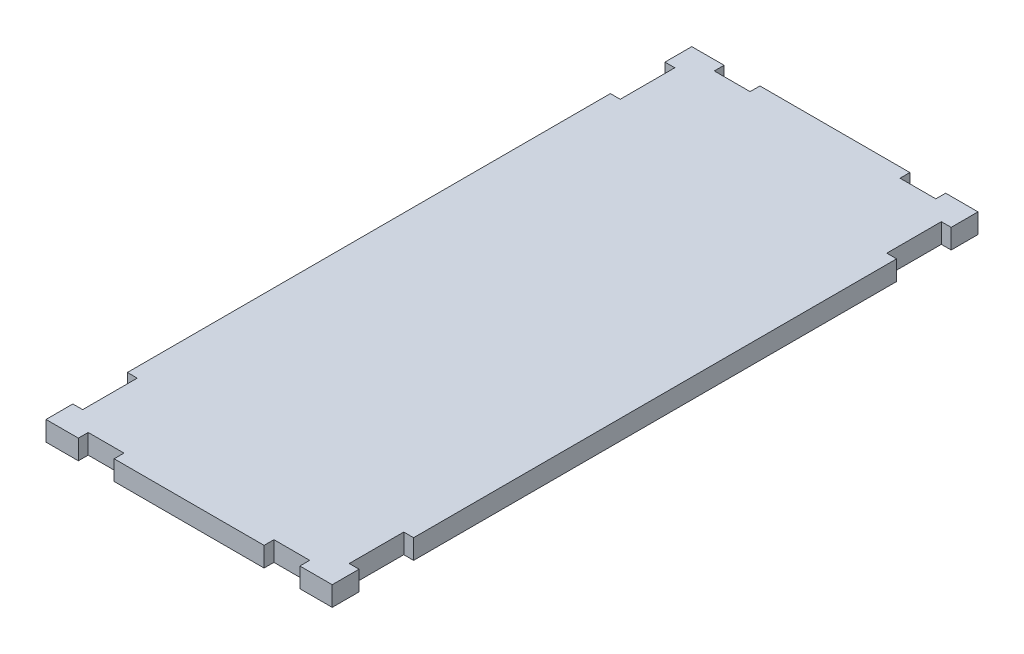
ISO-10303-21;
HEADER;
FILE_DESCRIPTION(('STEP AP214'),'2;1');
FILE_NAME('part.step','',(''),(''),'','','');
FILE_SCHEMA(('AUTOMOTIVE_DESIGN { 1 0 10303 214 1 1 1 1 }'));
ENDSEC;
DATA;
#1=APPLICATION_CONTEXT('core data for automotive mechanical design processes');
#2=APPLICATION_PROTOCOL_DEFINITION('international standard','automotive_design',2000,#1);
#3=PRODUCT_CONTEXT('',#1,'mechanical');
#4=PRODUCT('Part','Part','',(#3));
#5=PRODUCT_RELATED_PRODUCT_CATEGORY('part','',(#4));
#6=PRODUCT_DEFINITION_FORMATION('','',#4);
#7=PRODUCT_DEFINITION_CONTEXT('part definition',#1,'design');
#8=PRODUCT_DEFINITION('design','',#6,#7);
#9=PRODUCT_DEFINITION_SHAPE('','',#8);
#10=(LENGTH_UNIT() NAMED_UNIT(*) SI_UNIT(.MILLI.,.METRE.));
#11=(NAMED_UNIT(*) PLANE_ANGLE_UNIT() SI_UNIT($,.RADIAN.));
#12=(NAMED_UNIT(*) SI_UNIT($,.STERADIAN.) SOLID_ANGLE_UNIT());
#13=UNCERTAINTY_MEASURE_WITH_UNIT(LENGTH_MEASURE(1.E-05),#10,'distance_accuracy_value','');
#14=(GEOMETRIC_REPRESENTATION_CONTEXT(3) GLOBAL_UNCERTAINTY_ASSIGNED_CONTEXT((#13)) GLOBAL_UNIT_ASSIGNED_CONTEXT((#10,
#11,#12)) REPRESENTATION_CONTEXT('',''));
#15=CARTESIAN_POINT('',(0.,0.,0.));
#16=DIRECTION('',(0.,0.,1.));
#17=DIRECTION('',(1.,0.,0.));
#18=AXIS2_PLACEMENT_3D('',#15,#16,#17);
#19=CARTESIAN_POINT('',(80.0000000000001,5.5,0.));
#20=DIRECTION('',(-1.,0.,0.));
#21=DIRECTION('',(0.,0.,1.));
#22=AXIS2_PLACEMENT_3D('',#19,#20,#21);
#23=PLANE('',#22);
#24=DIRECTION('',(0.,0.,-1.));
#25=VECTOR('',#24,1.);
#26=CARTESIAN_POINT('',(80.0000000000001,0.,0.));
#27=LINE('',#26,#25);
#28=CARTESIAN_POINT('',(79.9999999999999,0.,-5.50000000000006));
#29=VERTEX_POINT('',#28);
#30=CARTESIAN_POINT('',(79.9999999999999,0.,-275.5));
#31=VERTEX_POINT('',#30);
#32=EDGE_CURVE('E568',#29,#31,#27,.T.);
#33=ORIENTED_EDGE('',*,*,#32,.T.);
#34=DIRECTION('',(0.,-1.,0.));
#35=VECTOR('',#34,1.);
#36=CARTESIAN_POINT('',(79.9999999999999,5.5,-275.5));
#37=LINE('',#36,#35);
#38=CARTESIAN_POINT('',(79.9999999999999,11.,-275.5));
#39=VERTEX_POINT('',#38);
#40=EDGE_CURVE('E11',#39,#31,#37,.T.);
#41=ORIENTED_EDGE('',*,*,#40,.F.);
#42=DIRECTION('',(0.,0.,-1.));
#43=VECTOR('',#42,1.);
#44=CARTESIAN_POINT('',(80.0000000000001,11.,0.));
#45=LINE('',#44,#43);
#46=CARTESIAN_POINT('',(79.9999999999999,11.,-5.50000000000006));
#47=VERTEX_POINT('',#46);
#48=EDGE_CURVE('E564',#47,#39,#45,.T.);
#49=ORIENTED_EDGE('',*,*,#48,.F.);
#50=DIRECTION('',(0.,-1.,0.));
#51=VECTOR('',#50,1.);
#52=CARTESIAN_POINT('',(79.9999999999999,5.5,-5.50000000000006));
#53=LINE('',#52,#51);
#54=EDGE_CURVE('E499',#47,#29,#53,.T.);
#55=ORIENTED_EDGE('',*,*,#54,.T.);
#56=EDGE_LOOP('',(#33,#41,#49,#55));
#57=FACE_BOUND('',#56,.T.);
#58=ADVANCED_FACE('F45',(#57),#23,.F.);
#59=CARTESIAN_POINT('',(0.,5.5,-275.5));
#60=DIRECTION('',(0.,0.,-1.));
#61=DIRECTION('',(-1.,0.,0.));
#62=AXIS2_PLACEMENT_3D('',#59,#60,#61);
#63=PLANE('',#62);
#64=DIRECTION('',(1.,0.,0.));
#65=VECTOR('',#64,1.);
#66=CARTESIAN_POINT('',(0.,0.,-275.5));
#67=LINE('',#66,#65);
#68=CARTESIAN_POINT('',(74.4999999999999,0.,-275.5));
#69=VERTEX_POINT('',#68);
#70=EDGE_CURVE('E572',#69,#31,#67,.T.);
#71=ORIENTED_EDGE('',*,*,#70,.F.);
#72=DIRECTION('',(0.,-1.,0.));
#73=VECTOR('',#72,1.);
#74=CARTESIAN_POINT('',(74.4999999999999,5.5,-275.5));
#75=LINE('',#74,#73);
#76=CARTESIAN_POINT('',(74.4999999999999,11.,-275.5));
#77=VERTEX_POINT('',#76);
#78=EDGE_CURVE('E53',#77,#69,#75,.T.);
#79=ORIENTED_EDGE('',*,*,#78,.F.);
#80=DIRECTION('',(1.,0.,0.));
#81=VECTOR('',#80,1.);
#82=CARTESIAN_POINT('',(0.,11.,-275.5));
#83=LINE('',#82,#81);
#84=EDGE_CURVE('E560',#77,#39,#83,.T.);
#85=ORIENTED_EDGE('',*,*,#84,.T.);
#86=ORIENTED_EDGE('',*,*,#40,.T.);
#87=EDGE_LOOP('',(#71,#79,#85,#86));
#88=FACE_BOUND('',#87,.T.);
#89=ADVANCED_FACE('F631',(#88),#63,.T.);
#90=CARTESIAN_POINT('',(74.4999999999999,5.5,0.));
#91=DIRECTION('',(1.,0.,0.));
#92=DIRECTION('',(0.,0.,-1.));
#93=AXIS2_PLACEMENT_3D('',#90,#91,#92);
#94=PLANE('',#93);
#95=DIRECTION('',(0.,0.,1.));
#96=VECTOR('',#95,1.);
#97=CARTESIAN_POINT('',(74.4999999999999,0.,0.));
#98=LINE('',#97,#96);
#99=CARTESIAN_POINT('',(74.4999999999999,0.,-306.));
#100=VERTEX_POINT('',#99);
#101=EDGE_CURVE('E576',#100,#69,#98,.T.);
#102=ORIENTED_EDGE('',*,*,#101,.F.);
#103=DIRECTION('',(0.,-1.,0.));
#104=VECTOR('',#103,1.);
#105=CARTESIAN_POINT('',(74.4999999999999,5.5,-306.));
#106=LINE('',#105,#104);
#107=CARTESIAN_POINT('',(74.4999999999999,11.,-306.));
#108=VERTEX_POINT('',#107);
#109=EDGE_CURVE('E621',#108,#100,#106,.T.);
#110=ORIENTED_EDGE('',*,*,#109,.F.);
#111=DIRECTION('',(0.,0.,1.));
#112=VECTOR('',#111,1.);
#113=CARTESIAN_POINT('',(74.4999999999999,11.,0.));
#114=LINE('',#113,#112);
#115=EDGE_CURVE('E556',#108,#77,#114,.T.);
#116=ORIENTED_EDGE('',*,*,#115,.T.);
#117=ORIENTED_EDGE('',*,*,#78,.T.);
#118=EDGE_LOOP('',(#102,#110,#116,#117));
#119=FACE_BOUND('',#118,.T.);
#120=ADVANCED_FACE('F627',(#119),#94,.T.);
#121=CARTESIAN_POINT('',(0.,5.5,-306.));
#122=DIRECTION('',(0.,0.,1.));
#123=DIRECTION('',(1.,0.,0.));
#124=AXIS2_PLACEMENT_3D('',#121,#122,#123);
#125=PLANE('',#124);
#126=DIRECTION('',(-1.,0.,0.));
#127=VECTOR('',#126,1.);
#128=CARTESIAN_POINT('',(0.,0.,-306.));
#129=LINE('',#128,#127);
#130=CARTESIAN_POINT('',(79.9999999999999,0.,-306.));
#131=VERTEX_POINT('',#130);
#132=EDGE_CURVE('E580',#131,#100,#129,.T.);
#133=ORIENTED_EDGE('',*,*,#132,.F.);
#134=DIRECTION('',(0.,-1.,0.));
#135=VECTOR('',#134,1.);
#136=CARTESIAN_POINT('',(79.9999999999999,5.5,-306.));
#137=LINE('',#136,#135);
#138=CARTESIAN_POINT('',(79.9999999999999,11.,-306.));
#139=VERTEX_POINT('',#138);
#140=EDGE_CURVE('E618',#139,#131,#137,.T.);
#141=ORIENTED_EDGE('',*,*,#140,.F.);
#142=DIRECTION('',(-1.,0.,0.));
#143=VECTOR('',#142,1.);
#144=CARTESIAN_POINT('',(0.,11.,-306.));
#145=LINE('',#144,#143);
#146=EDGE_CURVE('E552',#139,#108,#145,.T.);
#147=ORIENTED_EDGE('',*,*,#146,.T.);
#148=ORIENTED_EDGE('',*,*,#109,.T.);
#149=EDGE_LOOP('',(#133,#141,#147,#148));
#150=FACE_BOUND('',#149,.T.);
#151=ADVANCED_FACE('F637',(#150),#125,.T.);
#152=CARTESIAN_POINT('',(79.9999999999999,5.5,0.));
#153=DIRECTION('',(-1.,0.,0.));
#154=DIRECTION('',(0.,0.,1.));
#155=AXIS2_PLACEMENT_3D('',#152,#153,#154);
#156=PLANE('',#155);
#157=DIRECTION('',(0.,0.,-1.));
#158=VECTOR('',#157,1.);
#159=CARTESIAN_POINT('',(79.9999999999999,0.,0.));
#160=LINE('',#159,#158);
#161=CARTESIAN_POINT('',(79.9999999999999,0.,-321.));
#162=VERTEX_POINT('',#161);
#163=EDGE_CURVE('E584',#131,#162,#160,.T.);
#164=ORIENTED_EDGE('',*,*,#163,.T.);
#165=DIRECTION('',(0.,-1.,0.));
#166=VECTOR('',#165,1.);
#167=CARTESIAN_POINT('',(79.9999999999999,5.5,-321.));
#168=LINE('',#167,#166);
#169=CARTESIAN_POINT('',(79.9999999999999,11.,-321.));
#170=VERTEX_POINT('',#169);
#171=EDGE_CURVE('E615',#170,#162,#168,.T.);
#172=ORIENTED_EDGE('',*,*,#171,.F.);
#173=DIRECTION('',(0.,0.,-1.));
#174=VECTOR('',#173,1.);
#175=CARTESIAN_POINT('',(79.9999999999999,11.,0.));
#176=LINE('',#175,#174);
#177=EDGE_CURVE('E548',#139,#170,#176,.T.);
#178=ORIENTED_EDGE('',*,*,#177,.F.);
#179=ORIENTED_EDGE('',*,*,#140,.T.);
#180=EDGE_LOOP('',(#164,#172,#178,#179));
#181=FACE_BOUND('',#180,.T.);
#182=ADVANCED_FACE('F775',(#181),#156,.F.);
#183=CARTESIAN_POINT('',(0.,5.5,-321.));
#184=DIRECTION('',(0.,0.,-1.));
#185=DIRECTION('',(-1.,0.,0.));
#186=AXIS2_PLACEMENT_3D('',#183,#184,#185);
#187=PLANE('',#186);
#188=DIRECTION('',(1.,0.,0.));
#189=VECTOR('',#188,1.);
#190=CARTESIAN_POINT('',(0.,0.,-321.));
#191=LINE('',#190,#189);
#192=CARTESIAN_POINT('',(61.9142802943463,0.,-321.));
#193=VERTEX_POINT('',#192);
#194=EDGE_CURVE('E588',#193,#162,#191,.T.);
#195=ORIENTED_EDGE('',*,*,#194,.F.);
#196=DIRECTION('',(0.,-1.,0.));
#197=VECTOR('',#196,1.);
#198=CARTESIAN_POINT('',(61.9142802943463,5.5,-321.));
#199=LINE('',#198,#197);
#200=CARTESIAN_POINT('',(61.9142802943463,11.,-321.));
#201=VERTEX_POINT('',#200);
#202=EDGE_CURVE('E612',#201,#193,#199,.T.);
#203=ORIENTED_EDGE('',*,*,#202,.F.);
#204=DIRECTION('',(1.,0.,0.));
#205=VECTOR('',#204,1.);
#206=CARTESIAN_POINT('',(0.,11.,-321.));
#207=LINE('',#206,#205);
#208=EDGE_CURVE('E544',#201,#170,#207,.T.);
#209=ORIENTED_EDGE('',*,*,#208,.T.);
#210=ORIENTED_EDGE('',*,*,#171,.T.);
#211=EDGE_LOOP('',(#195,#203,#209,#210));
#212=FACE_BOUND('',#211,.T.);
#213=ADVANCED_FACE('F778',(#212),#187,.T.);
#214=CARTESIAN_POINT('',(61.9142802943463,5.5,0.));
#215=DIRECTION('',(1.,0.,0.));
#216=DIRECTION('',(0.,0.,-1.));
#217=AXIS2_PLACEMENT_3D('',#214,#215,#216);
#218=PLANE('',#217);
#219=DIRECTION('',(0.,0.,1.));
#220=VECTOR('',#219,1.);
#221=CARTESIAN_POINT('',(61.9142802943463,0.,0.));
#222=LINE('',#221,#220);
#223=CARTESIAN_POINT('',(61.9142802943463,0.,-315.5));
#224=VERTEX_POINT('',#223);
#225=EDGE_CURVE('E592',#193,#224,#222,.T.);
#226=ORIENTED_EDGE('',*,*,#225,.T.);
#227=DIRECTION('',(0.,-1.,0.));
#228=VECTOR('',#227,1.);
#229=CARTESIAN_POINT('',(61.9142802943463,5.5,-315.5));
#230=LINE('',#229,#228);
#231=CARTESIAN_POINT('',(61.9142802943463,11.,-315.5));
#232=VERTEX_POINT('',#231);
#233=EDGE_CURVE('E609',#232,#224,#230,.T.);
#234=ORIENTED_EDGE('',*,*,#233,.F.);
#235=DIRECTION('',(0.,0.,1.));
#236=VECTOR('',#235,1.);
#237=CARTESIAN_POINT('',(61.9142802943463,11.,0.));
#238=LINE('',#237,#236);
#239=EDGE_CURVE('E540',#201,#232,#238,.T.);
#240=ORIENTED_EDGE('',*,*,#239,.F.);
#241=ORIENTED_EDGE('',*,*,#202,.T.);
#242=EDGE_LOOP('',(#226,#234,#240,#241));
#243=FACE_BOUND('',#242,.T.);
#244=ADVANCED_FACE('F782',(#243),#218,.F.);
#245=CARTESIAN_POINT('',(0.,5.5,-315.5));
#246=DIRECTION('',(0.,0.,1.));
#247=DIRECTION('',(1.,0.,0.));
#248=AXIS2_PLACEMENT_3D('',#245,#246,#247);
#249=PLANE('',#248);
#250=DIRECTION('',(-1.,0.,0.));
#251=VECTOR('',#250,1.);
#252=CARTESIAN_POINT('',(0.,0.,-315.5));
#253=LINE('',#252,#251);
#254=CARTESIAN_POINT('',(41.9142802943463,0.,-315.5));
#255=VERTEX_POINT('',#254);
#256=EDGE_CURVE('E68',#224,#255,#253,.T.);
#257=ORIENTED_EDGE('',*,*,#256,.T.);
#258=DIRECTION('',(0.,-1.,0.));
#259=VECTOR('',#258,1.);
#260=CARTESIAN_POINT('',(41.9142802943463,5.5,-315.5));
#261=LINE('',#260,#259);
#262=CARTESIAN_POINT('',(41.9142802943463,11.,-315.5));
#263=VERTEX_POINT('',#262);
#264=EDGE_CURVE('E606',#263,#255,#261,.T.);
#265=ORIENTED_EDGE('',*,*,#264,.F.);
#266=DIRECTION('',(-1.,0.,0.));
#267=VECTOR('',#266,1.);
#268=CARTESIAN_POINT('',(0.,11.,-315.5));
#269=LINE('',#268,#267);
#270=EDGE_CURVE('E536',#232,#263,#269,.T.);
#271=ORIENTED_EDGE('',*,*,#270,.F.);
#272=ORIENTED_EDGE('',*,*,#233,.T.);
#273=EDGE_LOOP('',(#257,#265,#271,#272));
#274=FACE_BOUND('',#273,.T.);
#275=ADVANCED_FACE('F786',(#274),#249,.F.);
#276=CARTESIAN_POINT('',(41.9142802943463,5.5,0.));
#277=DIRECTION('',(-1.,0.,0.));
#278=DIRECTION('',(0.,0.,1.));
#279=AXIS2_PLACEMENT_3D('',#276,#277,#278);
#280=PLANE('',#279);
#281=DIRECTION('',(0.,0.,-1.));
#282=VECTOR('',#281,1.);
#283=CARTESIAN_POINT('',(41.9142802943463,0.,0.));
#284=LINE('',#283,#282);
#285=CARTESIAN_POINT('',(41.9142802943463,0.,-321.));
#286=VERTEX_POINT('',#285);
#287=EDGE_CURVE('E597',#255,#286,#284,.T.);
#288=ORIENTED_EDGE('',*,*,#287,.T.);
#289=DIRECTION('',(0.,-1.,0.));
#290=VECTOR('',#289,1.);
#291=CARTESIAN_POINT('',(41.9142802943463,5.5,-321.));
#292=LINE('',#291,#290);
#293=CARTESIAN_POINT('',(41.9142802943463,11.,-321.));
#294=VERTEX_POINT('',#293);
#295=EDGE_CURVE('E60',#294,#286,#292,.T.);
#296=ORIENTED_EDGE('',*,*,#295,.F.);
#297=DIRECTION('',(0.,0.,-1.));
#298=VECTOR('',#297,1.);
#299=CARTESIAN_POINT('',(41.9142802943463,11.,0.));
#300=LINE('',#299,#298);
#301=EDGE_CURVE('E532',#263,#294,#300,.T.);
#302=ORIENTED_EDGE('',*,*,#301,.F.);
#303=ORIENTED_EDGE('',*,*,#264,.T.);
#304=EDGE_LOOP('',(#288,#296,#302,#303));
#305=FACE_BOUND('',#304,.T.);
#306=ADVANCED_FACE('F790',(#305),#280,.F.);
#307=CARTESIAN_POINT('',(0.,5.5,-321.));
#308=DIRECTION('',(0.,0.,-1.));
#309=DIRECTION('',(-1.,0.,0.));
#310=AXIS2_PLACEMENT_3D('',#307,#308,#309);
#311=PLANE('',#310);
#312=DIRECTION('',(1.,0.,0.));
#313=VECTOR('',#312,1.);
#314=CARTESIAN_POINT('',(0.,0.,-321.));
#315=LINE('',#314,#313);
#316=CARTESIAN_POINT('',(-41.9142802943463,0.,-321.));
#317=VERTEX_POINT('',#316);
#318=EDGE_CURVE('E600',#317,#286,#315,.T.);
#319=ORIENTED_EDGE('',*,*,#318,.F.);
#320=DIRECTION('',(0.,-1.,0.));
#321=VECTOR('',#320,1.);
#322=CARTESIAN_POINT('',(-41.9142802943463,5.5,-321.));
#323=LINE('',#322,#321);
#324=CARTESIAN_POINT('',(-41.9142802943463,11.,-321.));
#325=VERTEX_POINT('',#324);
#326=EDGE_CURVE('E394',#325,#317,#323,.T.);
#327=ORIENTED_EDGE('',*,*,#326,.F.);
#328=DIRECTION('',(1.,0.,0.));
#329=VECTOR('',#328,1.);
#330=CARTESIAN_POINT('',(0.,11.,-321.));
#331=LINE('',#330,#329);
#332=EDGE_CURVE('E529',#325,#294,#331,.T.);
#333=ORIENTED_EDGE('',*,*,#332,.T.);
#334=ORIENTED_EDGE('',*,*,#295,.T.);
#335=EDGE_LOOP('',(#319,#327,#333,#334));
#336=FACE_BOUND('',#335,.T.);
#337=ADVANCED_FACE('F793',(#336),#311,.T.);
#338=CARTESIAN_POINT('',(0.,0.,0.));
#339=DIRECTION('',(0.,1.,0.));
#340=DIRECTION('',(0.,0.,1.));
#341=AXIS2_PLACEMENT_3D('',#338,#339,#340);
#342=PLANE('',#341);
#343=DIRECTION('',(1.,0.,0.));
#344=VECTOR('',#343,1.);
#345=CARTESIAN_POINT('',(0.,0.,40.));
#346=LINE('',#345,#344);
#347=CARTESIAN_POINT('',(-41.9142802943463,0.,40.));
#348=VERTEX_POINT('',#347);
#349=CARTESIAN_POINT('',(41.9142802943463,0.,40.));
#350=VERTEX_POINT('',#349);
#351=EDGE_CURVE('E465',#348,#350,#346,.T.);
#352=ORIENTED_EDGE('',*,*,#351,.F.);
#353=DIRECTION('',(0.,0.,1.));
#354=VECTOR('',#353,1.);
#355=CARTESIAN_POINT('',(-41.9142802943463,0.,-281.));
#356=LINE('',#355,#354);
#357=CARTESIAN_POINT('',(-41.9142802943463,0.,34.5));
#358=VERTEX_POINT('',#357);
#359=EDGE_CURVE('E682',#358,#348,#356,.T.);
#360=ORIENTED_EDGE('',*,*,#359,.F.);
#361=DIRECTION('',(1.,0.,0.));
#362=VECTOR('',#361,1.);
#363=CARTESIAN_POINT('',(0.,0.,34.5));
#364=LINE('',#363,#362);
#365=CARTESIAN_POINT('',(-61.9142802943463,0.,34.5));
#366=VERTEX_POINT('',#365);
#367=EDGE_CURVE('E687',#366,#358,#364,.T.);
#368=ORIENTED_EDGE('',*,*,#367,.F.);
#369=DIRECTION('',(0.,0.,-1.));
#370=VECTOR('',#369,1.);
#371=CARTESIAN_POINT('',(-61.9142802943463,0.,-281.));
#372=LINE('',#371,#370);
#373=CARTESIAN_POINT('',(-61.9142802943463,0.,40.));
#374=VERTEX_POINT('',#373);
#375=EDGE_CURVE('E692',#374,#366,#372,.T.);
#376=ORIENTED_EDGE('',*,*,#375,.F.);
#377=DIRECTION('',(-1.,0.,0.));
#378=VECTOR('',#377,1.);
#379=CARTESIAN_POINT('',(0.,0.,40.));
#380=LINE('',#379,#378);
#381=CARTESIAN_POINT('',(-79.9999999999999,0.,40.));
#382=VERTEX_POINT('',#381);
#383=EDGE_CURVE('E701',#374,#382,#380,.T.);
#384=ORIENTED_EDGE('',*,*,#383,.T.);
#385=DIRECTION('',(0.,0.,1.));
#386=VECTOR('',#385,1.);
#387=CARTESIAN_POINT('',(-79.9999999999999,0.,-281.));
#388=LINE('',#387,#386);
#389=CARTESIAN_POINT('',(-79.9999999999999,0.,25.));
#390=VERTEX_POINT('',#389);
#391=EDGE_CURVE('E705',#390,#382,#388,.T.);
#392=ORIENTED_EDGE('',*,*,#391,.F.);
#393=DIRECTION('',(1.,0.,0.));
#394=VECTOR('',#393,1.);
#395=CARTESIAN_POINT('',(0.,0.,25.));
#396=LINE('',#395,#394);
#397=CARTESIAN_POINT('',(-74.4999999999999,0.,25.));
#398=VERTEX_POINT('',#397);
#399=EDGE_CURVE('E709',#390,#398,#396,.T.);
#400=ORIENTED_EDGE('',*,*,#399,.T.);
#401=DIRECTION('',(0.,0.,-1.));
#402=VECTOR('',#401,1.);
#403=CARTESIAN_POINT('',(-74.4999999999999,0.,-281.));
#404=LINE('',#403,#402);
#405=CARTESIAN_POINT('',(-74.4999999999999,0.,-5.50000000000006));
#406=VERTEX_POINT('',#405);
#407=EDGE_CURVE('E312',#398,#406,#404,.T.);
#408=ORIENTED_EDGE('',*,*,#407,.T.);
#409=DIRECTION('',(-1.,0.,0.));
#410=VECTOR('',#409,1.);
#411=CARTESIAN_POINT('',(0.,0.,-5.50000000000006));
#412=LINE('',#411,#410);
#413=CARTESIAN_POINT('',(-79.9999999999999,0.,-5.50000000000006));
#414=VERTEX_POINT('',#413);
#415=EDGE_CURVE('E306',#406,#414,#412,.T.);
#416=ORIENTED_EDGE('',*,*,#415,.T.);
#417=DIRECTION('',(0.,0.,-1.));
#418=VECTOR('',#417,1.);
#419=CARTESIAN_POINT('',(-80.0000000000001,0.,0.));
#420=LINE('',#419,#418);
#421=CARTESIAN_POINT('',(-79.9999999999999,0.,-275.5));
#422=VERTEX_POINT('',#421);
#423=EDGE_CURVE('E301',#414,#422,#420,.T.);
#424=ORIENTED_EDGE('',*,*,#423,.T.);
#425=DIRECTION('',(-1.,0.,0.));
#426=VECTOR('',#425,1.);
#427=CARTESIAN_POINT('',(0.,0.,-275.5));
#428=LINE('',#427,#426);
#429=CARTESIAN_POINT('',(-74.4999999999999,0.,-275.5));
#430=VERTEX_POINT('',#429);
#431=EDGE_CURVE('E366',#430,#422,#428,.T.);
#432=ORIENTED_EDGE('',*,*,#431,.F.);
#433=DIRECTION('',(0.,0.,1.));
#434=VECTOR('',#433,1.);
#435=CARTESIAN_POINT('',(-74.4999999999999,0.,0.));
#436=LINE('',#435,#434);
#437=CARTESIAN_POINT('',(-74.4999999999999,0.,-306.));
#438=VERTEX_POINT('',#437);
#439=EDGE_CURVE('E369',#438,#430,#436,.T.);
#440=ORIENTED_EDGE('',*,*,#439,.F.);
#441=DIRECTION('',(1.,0.,0.));
#442=VECTOR('',#441,1.);
#443=CARTESIAN_POINT('',(0.,0.,-306.));
#444=LINE('',#443,#442);
#445=CARTESIAN_POINT('',(-79.9999999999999,0.,-306.));
#446=VERTEX_POINT('',#445);
#447=EDGE_CURVE('E372',#446,#438,#444,.T.);
#448=ORIENTED_EDGE('',*,*,#447,.F.);
#449=DIRECTION('',(0.,0.,-1.));
#450=VECTOR('',#449,1.);
#451=CARTESIAN_POINT('',(-79.9999999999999,0.,0.));
#452=LINE('',#451,#450);
#453=CARTESIAN_POINT('',(-79.9999999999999,0.,-321.));
#454=VERTEX_POINT('',#453);
#455=EDGE_CURVE('E375',#446,#454,#452,.T.);
#456=ORIENTED_EDGE('',*,*,#455,.T.);
#457=DIRECTION('',(-1.,0.,0.));
#458=VECTOR('',#457,1.);
#459=CARTESIAN_POINT('',(0.,0.,-321.));
#460=LINE('',#459,#458);
#461=CARTESIAN_POINT('',(-61.9142802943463,0.,-321.));
#462=VERTEX_POINT('',#461);
#463=EDGE_CURVE('E379',#462,#454,#460,.T.);
#464=ORIENTED_EDGE('',*,*,#463,.F.);
#465=DIRECTION('',(0.,0.,1.));
#466=VECTOR('',#465,1.);
#467=CARTESIAN_POINT('',(-61.9142802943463,0.,0.));
#468=LINE('',#467,#466);
#469=CARTESIAN_POINT('',(-61.9142802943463,0.,-315.5));
#470=VERTEX_POINT('',#469);
#471=EDGE_CURVE('E382',#462,#470,#468,.T.);
#472=ORIENTED_EDGE('',*,*,#471,.T.);
#473=DIRECTION('',(1.,0.,0.));
#474=VECTOR('',#473,1.);
#475=CARTESIAN_POINT('',(0.,0.,-315.5));
#476=LINE('',#475,#474);
#477=CARTESIAN_POINT('',(-41.9142802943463,0.,-315.5));
#478=VERTEX_POINT('',#477);
#479=EDGE_CURVE('E386',#470,#478,#476,.T.);
#480=ORIENTED_EDGE('',*,*,#479,.T.);
#481=DIRECTION('',(0.,0.,-1.));
#482=VECTOR('',#481,1.);
#483=CARTESIAN_POINT('',(-41.9142802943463,0.,0.));
#484=LINE('',#483,#482);
#485=EDGE_CURVE('E390',#478,#317,#484,.T.);
#486=ORIENTED_EDGE('',*,*,#485,.T.);
#487=ORIENTED_EDGE('',*,*,#318,.T.);
#488=ORIENTED_EDGE('',*,*,#287,.F.);
#489=ORIENTED_EDGE('',*,*,#256,.F.);
#490=ORIENTED_EDGE('',*,*,#225,.F.);
#491=ORIENTED_EDGE('',*,*,#194,.T.);
#492=ORIENTED_EDGE('',*,*,#163,.F.);
#493=ORIENTED_EDGE('',*,*,#132,.T.);
#494=ORIENTED_EDGE('',*,*,#101,.T.);
#495=ORIENTED_EDGE('',*,*,#70,.T.);
#496=ORIENTED_EDGE('',*,*,#32,.F.);
#497=DIRECTION('',(1.,0.,0.));
#498=VECTOR('',#497,1.);
#499=CARTESIAN_POINT('',(0.,0.,-5.50000000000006));
#500=LINE('',#499,#498);
#501=CARTESIAN_POINT('',(74.4999999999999,0.,-5.50000000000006));
#502=VERTEX_POINT('',#501);
#503=EDGE_CURVE('E495',#502,#29,#500,.T.);
#504=ORIENTED_EDGE('',*,*,#503,.F.);
#505=DIRECTION('',(0.,0.,-1.));
#506=VECTOR('',#505,1.);
#507=CARTESIAN_POINT('',(74.4999999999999,0.,-281.));
#508=LINE('',#507,#506);
#509=CARTESIAN_POINT('',(74.4999999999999,0.,25.));
#510=VERTEX_POINT('',#509);
#511=EDGE_CURVE('E492',#510,#502,#508,.T.);
#512=ORIENTED_EDGE('',*,*,#511,.F.);
#513=DIRECTION('',(-1.,0.,0.));
#514=VECTOR('',#513,1.);
#515=CARTESIAN_POINT('',(0.,0.,25.));
#516=LINE('',#515,#514);
#517=CARTESIAN_POINT('',(79.9999999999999,0.,25.));
#518=VERTEX_POINT('',#517);
#519=EDGE_CURVE('E489',#518,#510,#516,.T.);
#520=ORIENTED_EDGE('',*,*,#519,.F.);
#521=DIRECTION('',(0.,0.,1.));
#522=VECTOR('',#521,1.);
#523=CARTESIAN_POINT('',(79.9999999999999,0.,-281.));
#524=LINE('',#523,#522);
#525=CARTESIAN_POINT('',(79.9999999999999,0.,40.));
#526=VERTEX_POINT('',#525);
#527=EDGE_CURVE('E485',#518,#526,#524,.T.);
#528=ORIENTED_EDGE('',*,*,#527,.T.);
#529=DIRECTION('',(1.,0.,0.));
#530=VECTOR('',#529,1.);
#531=CARTESIAN_POINT('',(0.,0.,40.));
#532=LINE('',#531,#530);
#533=CARTESIAN_POINT('',(61.9142802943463,0.,40.));
#534=VERTEX_POINT('',#533);
#535=EDGE_CURVE('E481',#534,#526,#532,.T.);
#536=ORIENTED_EDGE('',*,*,#535,.F.);
#537=DIRECTION('',(0.,0.,-1.));
#538=VECTOR('',#537,1.);
#539=CARTESIAN_POINT('',(61.9142802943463,0.,-281.));
#540=LINE('',#539,#538);
#541=CARTESIAN_POINT('',(61.9142802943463,0.,34.5));
#542=VERTEX_POINT('',#541);
#543=EDGE_CURVE('E477',#534,#542,#540,.T.);
#544=ORIENTED_EDGE('',*,*,#543,.T.);
#545=DIRECTION('',(-1.,0.,0.));
#546=VECTOR('',#545,1.);
#547=CARTESIAN_POINT('',(0.,0.,34.5));
#548=LINE('',#547,#546);
#549=CARTESIAN_POINT('',(41.9142802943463,0.,34.5));
#550=VERTEX_POINT('',#549);
#551=EDGE_CURVE('E473',#542,#550,#548,.T.);
#552=ORIENTED_EDGE('',*,*,#551,.T.);
#553=DIRECTION('',(0.,0.,1.));
#554=VECTOR('',#553,1.);
#555=CARTESIAN_POINT('',(41.9142802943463,0.,-281.));
#556=LINE('',#555,#554);
#557=EDGE_CURVE('E469',#550,#350,#556,.T.);
#558=ORIENTED_EDGE('',*,*,#557,.T.);
#559=EDGE_LOOP('',(#352,#360,#368,#376,#384,#392,#400,#408,#416,#424,#432,#440,#448,#456,#464,
#472,#480,#486,#487,#488,#489,#490,#491,#492,#493,#494,#495,#496,#504,#512,#520,#528,#536,#544,
#552,#558));
#560=FACE_BOUND('',#559,.T.);
#561=ADVANCED_FACE('F633',(#560),#342,.F.);
#562=CARTESIAN_POINT('',(0.,11.,0.));
#563=DIRECTION('',(0.,-1.,0.));
#564=DIRECTION('',(0.,0.,1.));
#565=AXIS2_PLACEMENT_3D('',#562,#563,#564);
#566=PLANE('',#565);
#567=ORIENTED_EDGE('',*,*,#332,.F.);
#568=DIRECTION('',(0.,0.,-1.));
#569=VECTOR('',#568,1.);
#570=CARTESIAN_POINT('',(-41.9142802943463,11.,0.));
#571=LINE('',#570,#569);
#572=CARTESIAN_POINT('',(-41.9142802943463,11.,-315.5));
#573=VERTEX_POINT('',#572);
#574=EDGE_CURVE('E337',#573,#325,#571,.T.);
#575=ORIENTED_EDGE('',*,*,#574,.F.);
#576=DIRECTION('',(1.,0.,0.));
#577=VECTOR('',#576,1.);
#578=CARTESIAN_POINT('',(0.,11.,-315.5));
#579=LINE('',#578,#577);
#580=CARTESIAN_POINT('',(-61.9142802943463,11.,-315.5));
#581=VERTEX_POINT('',#580);
#582=EDGE_CURVE('E341',#581,#573,#579,.T.);
#583=ORIENTED_EDGE('',*,*,#582,.F.);
#584=DIRECTION('',(0.,0.,1.));
#585=VECTOR('',#584,1.);
#586=CARTESIAN_POINT('',(-61.9142802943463,11.,0.));
#587=LINE('',#586,#585);
#588=CARTESIAN_POINT('',(-61.9142802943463,11.,-321.));
#589=VERTEX_POINT('',#588);
#590=EDGE_CURVE('E345',#589,#581,#587,.T.);
#591=ORIENTED_EDGE('',*,*,#590,.F.);
#592=DIRECTION('',(-1.,0.,0.));
#593=VECTOR('',#592,1.);
#594=CARTESIAN_POINT('',(0.,11.,-321.));
#595=LINE('',#594,#593);
#596=CARTESIAN_POINT('',(-79.9999999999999,11.,-321.));
#597=VERTEX_POINT('',#596);
#598=EDGE_CURVE('E349',#589,#597,#595,.T.);
#599=ORIENTED_EDGE('',*,*,#598,.T.);
#600=DIRECTION('',(0.,0.,-1.));
#601=VECTOR('',#600,1.);
#602=CARTESIAN_POINT('',(-79.9999999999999,11.,0.));
#603=LINE('',#602,#601);
#604=CARTESIAN_POINT('',(-79.9999999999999,11.,-306.));
#605=VERTEX_POINT('',#604);
#606=EDGE_CURVE('E352',#605,#597,#603,.T.);
#607=ORIENTED_EDGE('',*,*,#606,.F.);
#608=DIRECTION('',(1.,0.,0.));
#609=VECTOR('',#608,1.);
#610=CARTESIAN_POINT('',(0.,11.,-306.));
#611=LINE('',#610,#609);
#612=CARTESIAN_POINT('',(-74.4999999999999,11.,-306.));
#613=VERTEX_POINT('',#612);
#614=EDGE_CURVE('E356',#605,#613,#611,.T.);
#615=ORIENTED_EDGE('',*,*,#614,.T.);
#616=DIRECTION('',(0.,0.,1.));
#617=VECTOR('',#616,1.);
#618=CARTESIAN_POINT('',(-74.4999999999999,11.,0.));
#619=LINE('',#618,#617);
#620=CARTESIAN_POINT('',(-74.4999999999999,11.,-275.5));
#621=VERTEX_POINT('',#620);
#622=EDGE_CURVE('E359',#613,#621,#619,.T.);
#623=ORIENTED_EDGE('',*,*,#622,.T.);
#624=DIRECTION('',(-1.,0.,0.));
#625=VECTOR('',#624,1.);
#626=CARTESIAN_POINT('',(0.,11.,-275.5));
#627=LINE('',#626,#625);
#628=CARTESIAN_POINT('',(-79.9999999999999,11.,-275.5));
#629=VERTEX_POINT('',#628);
#630=EDGE_CURVE('E296',#621,#629,#627,.T.);
#631=ORIENTED_EDGE('',*,*,#630,.T.);
#632=DIRECTION('',(0.,0.,-1.));
#633=VECTOR('',#632,1.);
#634=CARTESIAN_POINT('',(-80.0000000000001,11.,0.));
#635=LINE('',#634,#633);
#636=CARTESIAN_POINT('',(-79.9999999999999,11.,-5.50000000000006));
#637=VERTEX_POINT('',#636);
#638=EDGE_CURVE('E293',#637,#629,#635,.T.);
#639=ORIENTED_EDGE('',*,*,#638,.F.);
#640=DIRECTION('',(-1.,0.,0.));
#641=VECTOR('',#640,1.);
#642=CARTESIAN_POINT('',(0.,11.,-5.50000000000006));
#643=LINE('',#642,#641);
#644=CARTESIAN_POINT('',(-74.4999999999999,11.,-5.50000000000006));
#645=VERTEX_POINT('',#644);
#646=EDGE_CURVE('E278',#645,#637,#643,.T.);
#647=ORIENTED_EDGE('',*,*,#646,.F.);
#648=DIRECTION('',(0.,0.,-1.));
#649=VECTOR('',#648,1.);
#650=CARTESIAN_POINT('',(-74.4999999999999,11.,-281.));
#651=LINE('',#650,#649);
#652=CARTESIAN_POINT('',(-74.4999999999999,11.,25.));
#653=VERTEX_POINT('',#652);
#654=EDGE_CURVE('E290',#653,#645,#651,.T.);
#655=ORIENTED_EDGE('',*,*,#654,.F.);
#656=DIRECTION('',(1.,0.,0.));
#657=VECTOR('',#656,1.);
#658=CARTESIAN_POINT('',(0.,11.,25.));
#659=LINE('',#658,#657);
#660=CARTESIAN_POINT('',(-79.9999999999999,11.,25.));
#661=VERTEX_POINT('',#660);
#662=EDGE_CURVE('E722',#661,#653,#659,.T.);
#663=ORIENTED_EDGE('',*,*,#662,.F.);
#664=DIRECTION('',(0.,0.,1.));
#665=VECTOR('',#664,1.);
#666=CARTESIAN_POINT('',(-79.9999999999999,11.,-281.));
#667=LINE('',#666,#665);
#668=CARTESIAN_POINT('',(-79.9999999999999,11.,40.));
#669=VERTEX_POINT('',#668);
#670=EDGE_CURVE('E725',#661,#669,#667,.T.);
#671=ORIENTED_EDGE('',*,*,#670,.T.);
#672=DIRECTION('',(-1.,0.,0.));
#673=VECTOR('',#672,1.);
#674=CARTESIAN_POINT('',(0.,11.,40.));
#675=LINE('',#674,#673);
#676=CARTESIAN_POINT('',(-61.9142802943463,11.,40.));
#677=VERTEX_POINT('',#676);
#678=EDGE_CURVE('E731',#677,#669,#675,.T.);
#679=ORIENTED_EDGE('',*,*,#678,.F.);
#680=DIRECTION('',(0.,0.,-1.));
#681=VECTOR('',#680,1.);
#682=CARTESIAN_POINT('',(-61.9142802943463,11.,-281.));
#683=LINE('',#682,#681);
#684=CARTESIAN_POINT('',(-61.9142802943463,11.,34.5));
#685=VERTEX_POINT('',#684);
#686=EDGE_CURVE('E735',#677,#685,#683,.T.);
#687=ORIENTED_EDGE('',*,*,#686,.T.);
#688=DIRECTION('',(1.,0.,0.));
#689=VECTOR('',#688,1.);
#690=CARTESIAN_POINT('',(0.,11.,34.5));
#691=LINE('',#690,#689);
#692=CARTESIAN_POINT('',(-41.9142802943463,11.,34.5));
#693=VERTEX_POINT('',#692);
#694=EDGE_CURVE('E694',#685,#693,#691,.T.);
#695=ORIENTED_EDGE('',*,*,#694,.T.);
#696=DIRECTION('',(0.,0.,1.));
#697=VECTOR('',#696,1.);
#698=CARTESIAN_POINT('',(-41.9142802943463,11.,-281.));
#699=LINE('',#698,#697);
#700=CARTESIAN_POINT('',(-41.9142802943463,11.,40.));
#701=VERTEX_POINT('',#700);
#702=EDGE_CURVE('E688',#693,#701,#699,.T.);
#703=ORIENTED_EDGE('',*,*,#702,.T.);
#704=DIRECTION('',(1.,0.,0.));
#705=VECTOR('',#704,1.);
#706=CARTESIAN_POINT('',(0.,11.,40.));
#707=LINE('',#706,#705);
#708=CARTESIAN_POINT('',(41.9142802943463,11.,40.));
#709=VERTEX_POINT('',#708);
#710=EDGE_CURVE('E461',#701,#709,#707,.T.);
#711=ORIENTED_EDGE('',*,*,#710,.T.);
#712=DIRECTION('',(0.,0.,1.));
#713=VECTOR('',#712,1.);
#714=CARTESIAN_POINT('',(41.9142802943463,11.,-281.));
#715=LINE('',#714,#713);
#716=CARTESIAN_POINT('',(41.9142802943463,11.,34.5));
#717=VERTEX_POINT('',#716);
#718=EDGE_CURVE('E457',#717,#709,#715,.T.);
#719=ORIENTED_EDGE('',*,*,#718,.F.);
#720=DIRECTION('',(-1.,0.,0.));
#721=VECTOR('',#720,1.);
#722=CARTESIAN_POINT('',(0.,11.,34.5));
#723=LINE('',#722,#721);
#724=CARTESIAN_POINT('',(61.9142802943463,11.,34.5));
#725=VERTEX_POINT('',#724);
#726=EDGE_CURVE('E453',#725,#717,#723,.T.);
#727=ORIENTED_EDGE('',*,*,#726,.F.);
#728=DIRECTION('',(0.,0.,-1.));
#729=VECTOR('',#728,1.);
#730=CARTESIAN_POINT('',(61.9142802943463,11.,-281.));
#731=LINE('',#730,#729);
#732=CARTESIAN_POINT('',(61.9142802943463,11.,40.));
#733=VERTEX_POINT('',#732);
#734=EDGE_CURVE('E449',#733,#725,#731,.T.);
#735=ORIENTED_EDGE('',*,*,#734,.F.);
#736=DIRECTION('',(1.,0.,0.));
#737=VECTOR('',#736,1.);
#738=CARTESIAN_POINT('',(0.,11.,40.));
#739=LINE('',#738,#737);
#740=CARTESIAN_POINT('',(79.9999999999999,11.,40.));
#741=VERTEX_POINT('',#740);
#742=EDGE_CURVE('E445',#733,#741,#739,.T.);
#743=ORIENTED_EDGE('',*,*,#742,.T.);
#744=DIRECTION('',(0.,0.,1.));
#745=VECTOR('',#744,1.);
#746=CARTESIAN_POINT('',(79.9999999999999,11.,-281.));
#747=LINE('',#746,#745);
#748=CARTESIAN_POINT('',(79.9999999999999,11.,25.));
#749=VERTEX_POINT('',#748);
#750=EDGE_CURVE('E441',#749,#741,#747,.T.);
#751=ORIENTED_EDGE('',*,*,#750,.F.);
#752=DIRECTION('',(-1.,0.,0.));
#753=VECTOR('',#752,1.);
#754=CARTESIAN_POINT('',(0.,11.,25.));
#755=LINE('',#754,#753);
#756=CARTESIAN_POINT('',(74.4999999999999,11.,25.));
#757=VERTEX_POINT('',#756);
#758=EDGE_CURVE('E437',#749,#757,#755,.T.);
#759=ORIENTED_EDGE('',*,*,#758,.T.);
#760=DIRECTION('',(0.,0.,-1.));
#761=VECTOR('',#760,1.);
#762=CARTESIAN_POINT('',(74.4999999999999,11.,-281.));
#763=LINE('',#762,#761);
#764=CARTESIAN_POINT('',(74.4999999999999,11.,-5.50000000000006));
#765=VERTEX_POINT('',#764);
#766=EDGE_CURVE('E433',#757,#765,#763,.T.);
#767=ORIENTED_EDGE('',*,*,#766,.T.);
#768=DIRECTION('',(1.,0.,0.));
#769=VECTOR('',#768,1.);
#770=CARTESIAN_POINT('',(0.,11.,-5.50000000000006));
#771=LINE('',#770,#769);
#772=EDGE_CURVE('E429',#765,#47,#771,.T.);
#773=ORIENTED_EDGE('',*,*,#772,.T.);
#774=ORIENTED_EDGE('',*,*,#48,.T.);
#775=ORIENTED_EDGE('',*,*,#84,.F.);
#776=ORIENTED_EDGE('',*,*,#115,.F.);
#777=ORIENTED_EDGE('',*,*,#146,.F.);
#778=ORIENTED_EDGE('',*,*,#177,.T.);
#779=ORIENTED_EDGE('',*,*,#208,.F.);
#780=ORIENTED_EDGE('',*,*,#239,.T.);
#781=ORIENTED_EDGE('',*,*,#270,.T.);
#782=ORIENTED_EDGE('',*,*,#301,.T.);
#783=EDGE_LOOP('',(#567,#575,#583,#591,#599,#607,#615,#623,#631,#639,#647,#655,#663,#671,#679,
#687,#695,#703,#711,#719,#727,#735,#743,#751,#759,#767,#773,#774,#775,#776,#777,#778,#779,#780,
#781,#782));
#784=FACE_BOUND('',#783,.T.);
#785=ADVANCED_FACE('F294',(#784),#566,.F.);
#786=CARTESIAN_POINT('',(0.,5.5,40.));
#787=DIRECTION('',(0.,0.,-1.));
#788=DIRECTION('',(-1.,0.,0.));
#789=AXIS2_PLACEMENT_3D('',#786,#787,#788);
#790=PLANE('',#789);
#791=ORIENTED_EDGE('',*,*,#351,.T.);
#792=DIRECTION('',(0.,-1.,0.));
#793=VECTOR('',#792,1.);
#794=CARTESIAN_POINT('',(41.9142802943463,5.5,40.));
#795=LINE('',#794,#793);
#796=EDGE_CURVE('E526',#709,#350,#795,.T.);
#797=ORIENTED_EDGE('',*,*,#796,.F.);
#798=ORIENTED_EDGE('',*,*,#710,.F.);
#799=DIRECTION('',(0.,-1.,0.));
#800=VECTOR('',#799,1.);
#801=CARTESIAN_POINT('',(-41.9142802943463,5.5,40.));
#802=LINE('',#801,#800);
#803=EDGE_CURVE('E333',#701,#348,#802,.T.);
#804=ORIENTED_EDGE('',*,*,#803,.T.);
#805=EDGE_LOOP('',(#791,#797,#798,#804));
#806=FACE_BOUND('',#805,.T.);
#807=ADVANCED_FACE('F676',(#806),#790,.F.);
#808=CARTESIAN_POINT('',(41.9142802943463,5.5,-281.));
#809=DIRECTION('',(1.,0.,0.));
#810=DIRECTION('',(0.,0.,-1.));
#811=AXIS2_PLACEMENT_3D('',#808,#809,#810);
#812=PLANE('',#811);
#813=ORIENTED_EDGE('',*,*,#557,.F.);
#814=DIRECTION('',(0.,-1.,0.));
#815=VECTOR('',#814,1.);
#816=CARTESIAN_POINT('',(41.9142802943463,5.5,34.5));
#817=LINE('',#816,#815);
#818=EDGE_CURVE('E523',#717,#550,#817,.T.);
#819=ORIENTED_EDGE('',*,*,#818,.F.);
#820=ORIENTED_EDGE('',*,*,#718,.T.);
#821=ORIENTED_EDGE('',*,*,#796,.T.);
#822=EDGE_LOOP('',(#813,#819,#820,#821));
#823=FACE_BOUND('',#822,.T.);
#824=ADVANCED_FACE('F673',(#823),#812,.T.);
#825=CARTESIAN_POINT('',(0.,5.5,34.5));
#826=DIRECTION('',(0.,0.,1.));
#827=DIRECTION('',(1.,0.,0.));
#828=AXIS2_PLACEMENT_3D('',#825,#826,#827);
#829=PLANE('',#828);
#830=ORIENTED_EDGE('',*,*,#551,.F.);
#831=DIRECTION('',(0.,-1.,0.));
#832=VECTOR('',#831,1.);
#833=CARTESIAN_POINT('',(61.9142802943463,5.5,34.5));
#834=LINE('',#833,#832);
#835=EDGE_CURVE('E520',#725,#542,#834,.T.);
#836=ORIENTED_EDGE('',*,*,#835,.F.);
#837=ORIENTED_EDGE('',*,*,#726,.T.);
#838=ORIENTED_EDGE('',*,*,#818,.T.);
#839=EDGE_LOOP('',(#830,#836,#837,#838));
#840=FACE_BOUND('',#839,.T.);
#841=ADVANCED_FACE('F669',(#840),#829,.T.);
#842=CARTESIAN_POINT('',(61.9142802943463,5.5,-281.));
#843=DIRECTION('',(-1.,0.,0.));
#844=DIRECTION('',(0.,0.,1.));
#845=AXIS2_PLACEMENT_3D('',#842,#843,#844);
#846=PLANE('',#845);
#847=ORIENTED_EDGE('',*,*,#543,.F.);
#848=DIRECTION('',(0.,-1.,0.));
#849=VECTOR('',#848,1.);
#850=CARTESIAN_POINT('',(61.9142802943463,5.5,40.));
#851=LINE('',#850,#849);
#852=EDGE_CURVE('E517',#733,#534,#851,.T.);
#853=ORIENTED_EDGE('',*,*,#852,.F.);
#854=ORIENTED_EDGE('',*,*,#734,.T.);
#855=ORIENTED_EDGE('',*,*,#835,.T.);
#856=EDGE_LOOP('',(#847,#853,#854,#855));
#857=FACE_BOUND('',#856,.T.);
#858=ADVANCED_FACE('F666',(#857),#846,.T.);
#859=CARTESIAN_POINT('',(0.,5.5,40.));
#860=DIRECTION('',(0.,0.,-1.));
#861=DIRECTION('',(-1.,0.,0.));
#862=AXIS2_PLACEMENT_3D('',#859,#860,#861);
#863=PLANE('',#862);
#864=ORIENTED_EDGE('',*,*,#535,.T.);
#865=DIRECTION('',(0.,-1.,0.));
#866=VECTOR('',#865,1.);
#867=CARTESIAN_POINT('',(79.9999999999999,5.5,40.));
#868=LINE('',#867,#866);
#869=EDGE_CURVE('E514',#741,#526,#868,.T.);
#870=ORIENTED_EDGE('',*,*,#869,.F.);
#871=ORIENTED_EDGE('',*,*,#742,.F.);
#872=ORIENTED_EDGE('',*,*,#852,.T.);
#873=EDGE_LOOP('',(#864,#870,#871,#872));
#874=FACE_BOUND('',#873,.T.);
#875=ADVANCED_FACE('F662',(#874),#863,.F.);
#876=CARTESIAN_POINT('',(79.9999999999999,5.5,-281.));
#877=DIRECTION('',(1.,0.,0.));
#878=DIRECTION('',(0.,0.,-1.));
#879=AXIS2_PLACEMENT_3D('',#876,#877,#878);
#880=PLANE('',#879);
#881=ORIENTED_EDGE('',*,*,#527,.F.);
#882=DIRECTION('',(0.,-1.,0.));
#883=VECTOR('',#882,1.);
#884=CARTESIAN_POINT('',(79.9999999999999,5.5,25.));
#885=LINE('',#884,#883);
#886=EDGE_CURVE('E511',#749,#518,#885,.T.);
#887=ORIENTED_EDGE('',*,*,#886,.F.);
#888=ORIENTED_EDGE('',*,*,#750,.T.);
#889=ORIENTED_EDGE('',*,*,#869,.T.);
#890=EDGE_LOOP('',(#881,#887,#888,#889));
#891=FACE_BOUND('',#890,.T.);
#892=ADVANCED_FACE('F657',(#891),#880,.T.);
#893=CARTESIAN_POINT('',(0.,5.5,25.));
#894=DIRECTION('',(0.,0.,1.));
#895=DIRECTION('',(1.,0.,0.));
#896=AXIS2_PLACEMENT_3D('',#893,#894,#895);
#897=PLANE('',#896);
#898=ORIENTED_EDGE('',*,*,#519,.T.);
#899=DIRECTION('',(0.,-1.,0.));
#900=VECTOR('',#899,1.);
#901=CARTESIAN_POINT('',(74.4999999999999,5.5,25.));
#902=LINE('',#901,#900);
#903=EDGE_CURVE('E507',#757,#510,#902,.T.);
#904=ORIENTED_EDGE('',*,*,#903,.F.);
#905=ORIENTED_EDGE('',*,*,#758,.F.);
#906=ORIENTED_EDGE('',*,*,#886,.T.);
#907=EDGE_LOOP('',(#898,#904,#905,#906));
#908=FACE_BOUND('',#907,.T.);
#909=ADVANCED_FACE('F654',(#908),#897,.F.);
#910=CARTESIAN_POINT('',(74.4999999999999,5.5,-281.));
#911=DIRECTION('',(-1.,0.,0.));
#912=DIRECTION('',(0.,0.,1.));
#913=AXIS2_PLACEMENT_3D('',#910,#911,#912);
#914=PLANE('',#913);
#915=ORIENTED_EDGE('',*,*,#511,.T.);
#916=DIRECTION('',(0.,-1.,0.));
#917=VECTOR('',#916,1.);
#918=CARTESIAN_POINT('',(74.4999999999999,5.5,-5.50000000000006));
#919=LINE('',#918,#917);
#920=EDGE_CURVE('E503',#765,#502,#919,.T.);
#921=ORIENTED_EDGE('',*,*,#920,.F.);
#922=ORIENTED_EDGE('',*,*,#766,.F.);
#923=ORIENTED_EDGE('',*,*,#903,.T.);
#924=EDGE_LOOP('',(#915,#921,#922,#923));
#925=FACE_BOUND('',#924,.T.);
#926=ADVANCED_FACE('F650',(#925),#914,.F.);
#927=CARTESIAN_POINT('',(0.,5.5,-5.50000000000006));
#928=DIRECTION('',(0.,0.,-1.));
#929=DIRECTION('',(-1.,0.,0.));
#930=AXIS2_PLACEMENT_3D('',#927,#928,#929);
#931=PLANE('',#930);
#932=ORIENTED_EDGE('',*,*,#503,.T.);
#933=ORIENTED_EDGE('',*,*,#54,.F.);
#934=ORIENTED_EDGE('',*,*,#772,.F.);
#935=ORIENTED_EDGE('',*,*,#920,.T.);
#936=EDGE_LOOP('',(#932,#933,#934,#935));
#937=FACE_BOUND('',#936,.T.);
#938=ADVANCED_FACE('F644',(#937),#931,.F.);
#939=CARTESIAN_POINT('',(-80.0000000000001,5.5,0.));
#940=DIRECTION('',(1.,0.,0.));
#941=DIRECTION('',(0.,0.,1.));
#942=AXIS2_PLACEMENT_3D('',#939,#940,#941);
#943=PLANE('',#942);
#944=ORIENTED_EDGE('',*,*,#423,.F.);
#945=DIRECTION('',(0.,-1.,0.));
#946=VECTOR('',#945,1.);
#947=CARTESIAN_POINT('',(-79.9999999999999,5.5,-5.50000000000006));
#948=LINE('',#947,#946);
#949=EDGE_CURVE('E283',#637,#414,#948,.T.);
#950=ORIENTED_EDGE('',*,*,#949,.F.);
#951=ORIENTED_EDGE('',*,*,#638,.T.);
#952=DIRECTION('',(0.,-1.,0.));
#953=VECTOR('',#952,1.);
#954=CARTESIAN_POINT('',(-79.9999999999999,5.5,-275.5));
#955=LINE('',#954,#953);
#956=EDGE_CURVE('E426',#629,#422,#955,.T.);
#957=ORIENTED_EDGE('',*,*,#956,.T.);
#958=EDGE_LOOP('',(#944,#950,#951,#957));
#959=FACE_BOUND('',#958,.T.);
#960=ADVANCED_FACE('F303',(#959),#943,.F.);
#961=CARTESIAN_POINT('',(0.,5.5,-275.5));
#962=DIRECTION('',(0.,0.,-1.));
#963=DIRECTION('',(1.,0.,0.));
#964=AXIS2_PLACEMENT_3D('',#961,#962,#963);
#965=PLANE('',#964);
#966=ORIENTED_EDGE('',*,*,#431,.T.);
#967=ORIENTED_EDGE('',*,*,#956,.F.);
#968=ORIENTED_EDGE('',*,*,#630,.F.);
#969=DIRECTION('',(0.,-1.,0.));
#970=VECTOR('',#969,1.);
#971=CARTESIAN_POINT('',(-74.4999999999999,5.5,-275.5));
#972=LINE('',#971,#970);
#973=EDGE_CURVE('E422',#621,#430,#972,.T.);
#974=ORIENTED_EDGE('',*,*,#973,.T.);
#975=EDGE_LOOP('',(#966,#967,#968,#974));
#976=FACE_BOUND('',#975,.T.);
#977=ADVANCED_FACE('F821',(#976),#965,.T.);
#978=CARTESIAN_POINT('',(-74.4999999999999,5.5,0.));
#979=DIRECTION('',(-1.,0.,0.));
#980=DIRECTION('',(0.,0.,-1.));
#981=AXIS2_PLACEMENT_3D('',#978,#979,#980);
#982=PLANE('',#981);
#983=ORIENTED_EDGE('',*,*,#439,.T.);
#984=ORIENTED_EDGE('',*,*,#973,.F.);
#985=ORIENTED_EDGE('',*,*,#622,.F.);
#986=DIRECTION('',(0.,-1.,0.));
#987=VECTOR('',#986,1.);
#988=CARTESIAN_POINT('',(-74.4999999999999,5.5,-306.));
#989=LINE('',#988,#987);
#990=EDGE_CURVE('E418',#613,#438,#989,.T.);
#991=ORIENTED_EDGE('',*,*,#990,.T.);
#992=EDGE_LOOP('',(#983,#984,#985,#991));
#993=FACE_BOUND('',#992,.T.);
#994=ADVANCED_FACE('F824',(#993),#982,.T.);
#995=CARTESIAN_POINT('',(0.,5.5,-306.));
#996=DIRECTION('',(0.,0.,1.));
#997=DIRECTION('',(-1.,0.,0.));
#998=AXIS2_PLACEMENT_3D('',#995,#996,#997);
#999=PLANE('',#998);
#1000=ORIENTED_EDGE('',*,*,#447,.T.);
#1001=ORIENTED_EDGE('',*,*,#990,.F.);
#1002=ORIENTED_EDGE('',*,*,#614,.F.);
#1003=DIRECTION('',(0.,-1.,0.));
#1004=VECTOR('',#1003,1.);
#1005=CARTESIAN_POINT('',(-79.9999999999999,5.5,-306.));
#1006=LINE('',#1005,#1004);
#1007=EDGE_CURVE('E414',#605,#446,#1006,.T.);
#1008=ORIENTED_EDGE('',*,*,#1007,.T.);
#1009=EDGE_LOOP('',(#1000,#1001,#1002,#1008));
#1010=FACE_BOUND('',#1009,.T.);
#1011=ADVANCED_FACE('F828',(#1010),#999,.T.);
#1012=CARTESIAN_POINT('',(-79.9999999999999,5.5,0.));
#1013=DIRECTION('',(1.,0.,0.));
#1014=DIRECTION('',(0.,0.,1.));
#1015=AXIS2_PLACEMENT_3D('',#1012,#1013,#1014);
#1016=PLANE('',#1015);
#1017=ORIENTED_EDGE('',*,*,#455,.F.);
#1018=ORIENTED_EDGE('',*,*,#1007,.F.);
#1019=ORIENTED_EDGE('',*,*,#606,.T.);
#1020=DIRECTION('',(0.,-1.,0.));
#1021=VECTOR('',#1020,1.);
#1022=CARTESIAN_POINT('',(-79.9999999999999,5.5,-321.));
#1023=LINE('',#1022,#1021);
#1024=EDGE_CURVE('E410',#597,#454,#1023,.T.);
#1025=ORIENTED_EDGE('',*,*,#1024,.T.);
#1026=EDGE_LOOP('',(#1017,#1018,#1019,#1025));
#1027=FACE_BOUND('',#1026,.T.);
#1028=ADVANCED_FACE('F832',(#1027),#1016,.F.);
#1029=CARTESIAN_POINT('',(0.,5.5,-321.));
#1030=DIRECTION('',(0.,0.,-1.));
#1031=DIRECTION('',(1.,0.,0.));
#1032=AXIS2_PLACEMENT_3D('',#1029,#1030,#1031);
#1033=PLANE('',#1032);
#1034=ORIENTED_EDGE('',*,*,#463,.T.);
#1035=ORIENTED_EDGE('',*,*,#1024,.F.);
#1036=ORIENTED_EDGE('',*,*,#598,.F.);
#1037=DIRECTION('',(0.,-1.,0.));
#1038=VECTOR('',#1037,1.);
#1039=CARTESIAN_POINT('',(-61.9142802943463,5.5,-321.));
#1040=LINE('',#1039,#1038);
#1041=EDGE_CURVE('E406',#589,#462,#1040,.T.);
#1042=ORIENTED_EDGE('',*,*,#1041,.T.);
#1043=EDGE_LOOP('',(#1034,#1035,#1036,#1042));
#1044=FACE_BOUND('',#1043,.T.);
#1045=ADVANCED_FACE('F836',(#1044),#1033,.T.);
#1046=CARTESIAN_POINT('',(-61.9142802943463,5.5,0.));
#1047=DIRECTION('',(-1.,0.,0.));
#1048=DIRECTION('',(0.,0.,-1.));
#1049=AXIS2_PLACEMENT_3D('',#1046,#1047,#1048);
#1050=PLANE('',#1049);
#1051=ORIENTED_EDGE('',*,*,#471,.F.);
#1052=ORIENTED_EDGE('',*,*,#1041,.F.);
#1053=ORIENTED_EDGE('',*,*,#590,.T.);
#1054=DIRECTION('',(0.,-1.,0.));
#1055=VECTOR('',#1054,1.);
#1056=CARTESIAN_POINT('',(-61.9142802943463,5.5,-315.5));
#1057=LINE('',#1056,#1055);
#1058=EDGE_CURVE('E402',#581,#470,#1057,.T.);
#1059=ORIENTED_EDGE('',*,*,#1058,.T.);
#1060=EDGE_LOOP('',(#1051,#1052,#1053,#1059));
#1061=FACE_BOUND('',#1060,.T.);
#1062=ADVANCED_FACE('F840',(#1061),#1050,.F.);
#1063=CARTESIAN_POINT('',(0.,5.5,-315.5));
#1064=DIRECTION('',(0.,0.,1.));
#1065=DIRECTION('',(-1.,0.,0.));
#1066=AXIS2_PLACEMENT_3D('',#1063,#1064,#1065);
#1067=PLANE('',#1066);
#1068=ORIENTED_EDGE('',*,*,#479,.F.);
#1069=ORIENTED_EDGE('',*,*,#1058,.F.);
#1070=ORIENTED_EDGE('',*,*,#582,.T.);
#1071=DIRECTION('',(0.,-1.,0.));
#1072=VECTOR('',#1071,1.);
#1073=CARTESIAN_POINT('',(-41.9142802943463,5.5,-315.5));
#1074=LINE('',#1073,#1072);
#1075=EDGE_CURVE('E398',#573,#478,#1074,.T.);
#1076=ORIENTED_EDGE('',*,*,#1075,.T.);
#1077=EDGE_LOOP('',(#1068,#1069,#1070,#1076));
#1078=FACE_BOUND('',#1077,.T.);
#1079=ADVANCED_FACE('F844',(#1078),#1067,.F.);
#1080=CARTESIAN_POINT('',(-41.9142802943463,5.5,0.));
#1081=DIRECTION('',(1.,0.,0.));
#1082=DIRECTION('',(0.,0.,1.));
#1083=AXIS2_PLACEMENT_3D('',#1080,#1081,#1082);
#1084=PLANE('',#1083);
#1085=ORIENTED_EDGE('',*,*,#485,.F.);
#1086=ORIENTED_EDGE('',*,*,#1075,.F.);
#1087=ORIENTED_EDGE('',*,*,#574,.T.);
#1088=ORIENTED_EDGE('',*,*,#326,.T.);
#1089=EDGE_LOOP('',(#1085,#1086,#1087,#1088));
#1090=FACE_BOUND('',#1089,.T.);
#1091=ADVANCED_FACE('F848',(#1090),#1084,.F.);
#1092=CARTESIAN_POINT('',(-41.9142802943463,5.5,-281.));
#1093=DIRECTION('',(-1.,0.,0.));
#1094=DIRECTION('',(0.,0.,-1.));
#1095=AXIS2_PLACEMENT_3D('',#1092,#1093,#1094);
#1096=PLANE('',#1095);
#1097=ORIENTED_EDGE('',*,*,#359,.T.);
#1098=ORIENTED_EDGE('',*,*,#803,.F.);
#1099=ORIENTED_EDGE('',*,*,#702,.F.);
#1100=DIRECTION('',(0.,-1.,0.));
#1101=VECTOR('',#1100,1.);
#1102=CARTESIAN_POINT('',(-41.9142802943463,5.5,34.5));
#1103=LINE('',#1102,#1101);
#1104=EDGE_CURVE('E330',#693,#358,#1103,.T.);
#1105=ORIENTED_EDGE('',*,*,#1104,.T.);
#1106=EDGE_LOOP('',(#1097,#1098,#1099,#1105));
#1107=FACE_BOUND('',#1106,.T.);
#1108=ADVANCED_FACE('F683',(#1107),#1096,.T.);
#1109=CARTESIAN_POINT('',(0.,5.5,34.5));
#1110=DIRECTION('',(0.,0.,1.));
#1111=DIRECTION('',(-1.,0.,0.));
#1112=AXIS2_PLACEMENT_3D('',#1109,#1110,#1111);
#1113=PLANE('',#1112);
#1114=ORIENTED_EDGE('',*,*,#367,.T.);
#1115=ORIENTED_EDGE('',*,*,#1104,.F.);
#1116=ORIENTED_EDGE('',*,*,#694,.F.);
#1117=DIRECTION('',(0.,-1.,0.));
#1118=VECTOR('',#1117,1.);
#1119=CARTESIAN_POINT('',(-61.9142802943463,5.5,34.5));
#1120=LINE('',#1119,#1118);
#1121=EDGE_CURVE('E327',#685,#366,#1120,.T.);
#1122=ORIENTED_EDGE('',*,*,#1121,.T.);
#1123=EDGE_LOOP('',(#1114,#1115,#1116,#1122));
#1124=FACE_BOUND('',#1123,.T.);
#1125=ADVANCED_FACE('F744',(#1124),#1113,.T.);
#1126=CARTESIAN_POINT('',(-61.9142802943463,5.5,-281.));
#1127=DIRECTION('',(1.,0.,0.));
#1128=DIRECTION('',(0.,0.,1.));
#1129=AXIS2_PLACEMENT_3D('',#1126,#1127,#1128);
#1130=PLANE('',#1129);
#1131=ORIENTED_EDGE('',*,*,#375,.T.);
#1132=ORIENTED_EDGE('',*,*,#1121,.F.);
#1133=ORIENTED_EDGE('',*,*,#686,.F.);
#1134=DIRECTION('',(0.,-1.,0.));
#1135=VECTOR('',#1134,1.);
#1136=CARTESIAN_POINT('',(-61.9142802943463,5.5,40.));
#1137=LINE('',#1136,#1135);
#1138=EDGE_CURVE('E324',#677,#374,#1137,.T.);
#1139=ORIENTED_EDGE('',*,*,#1138,.T.);
#1140=EDGE_LOOP('',(#1131,#1132,#1133,#1139));
#1141=FACE_BOUND('',#1140,.T.);
#1142=ADVANCED_FACE('F748',(#1141),#1130,.T.);
#1143=CARTESIAN_POINT('',(0.,5.5,40.));
#1144=DIRECTION('',(0.,0.,-1.));
#1145=DIRECTION('',(1.,0.,0.));
#1146=AXIS2_PLACEMENT_3D('',#1143,#1144,#1145);
#1147=PLANE('',#1146);
#1148=ORIENTED_EDGE('',*,*,#383,.F.);
#1149=ORIENTED_EDGE('',*,*,#1138,.F.);
#1150=ORIENTED_EDGE('',*,*,#678,.T.);
#1151=DIRECTION('',(0.,-1.,0.));
#1152=VECTOR('',#1151,1.);
#1153=CARTESIAN_POINT('',(-79.9999999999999,5.5,40.));
#1154=LINE('',#1153,#1152);
#1155=EDGE_CURVE('E321',#669,#382,#1154,.T.);
#1156=ORIENTED_EDGE('',*,*,#1155,.T.);
#1157=EDGE_LOOP('',(#1148,#1149,#1150,#1156));
#1158=FACE_BOUND('',#1157,.T.);
#1159=ADVANCED_FACE('F750',(#1158),#1147,.F.);
#1160=CARTESIAN_POINT('',(-79.9999999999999,5.5,-281.));
#1161=DIRECTION('',(-1.,0.,0.));
#1162=DIRECTION('',(0.,0.,-1.));
#1163=AXIS2_PLACEMENT_3D('',#1160,#1161,#1162);
#1164=PLANE('',#1163);
#1165=ORIENTED_EDGE('',*,*,#391,.T.);
#1166=ORIENTED_EDGE('',*,*,#1155,.F.);
#1167=ORIENTED_EDGE('',*,*,#670,.F.);
#1168=DIRECTION('',(0.,-1.,0.));
#1169=VECTOR('',#1168,1.);
#1170=CARTESIAN_POINT('',(-79.9999999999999,5.5,25.));
#1171=LINE('',#1170,#1169);
#1172=EDGE_CURVE('E318',#661,#390,#1171,.T.);
#1173=ORIENTED_EDGE('',*,*,#1172,.T.);
#1174=EDGE_LOOP('',(#1165,#1166,#1167,#1173));
#1175=FACE_BOUND('',#1174,.T.);
#1176=ADVANCED_FACE('F753',(#1175),#1164,.T.);
#1177=CARTESIAN_POINT('',(0.,5.5,25.));
#1178=DIRECTION('',(0.,0.,1.));
#1179=DIRECTION('',(-1.,0.,0.));
#1180=AXIS2_PLACEMENT_3D('',#1177,#1178,#1179);
#1181=PLANE('',#1180);
#1182=ORIENTED_EDGE('',*,*,#399,.F.);
#1183=ORIENTED_EDGE('',*,*,#1172,.F.);
#1184=ORIENTED_EDGE('',*,*,#662,.T.);
#1185=DIRECTION('',(0.,-1.,0.));
#1186=VECTOR('',#1185,1.);
#1187=CARTESIAN_POINT('',(-74.4999999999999,5.5,25.));
#1188=LINE('',#1187,#1186);
#1189=EDGE_CURVE('E310',#653,#398,#1188,.T.);
#1190=ORIENTED_EDGE('',*,*,#1189,.T.);
#1191=EDGE_LOOP('',(#1182,#1183,#1184,#1190));
#1192=FACE_BOUND('',#1191,.T.);
#1193=ADVANCED_FACE('F755',(#1192),#1181,.F.);
#1194=CARTESIAN_POINT('',(-74.4999999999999,5.5,-281.));
#1195=DIRECTION('',(1.,0.,0.));
#1196=DIRECTION('',(0.,0.,1.));
#1197=AXIS2_PLACEMENT_3D('',#1194,#1195,#1196);
#1198=PLANE('',#1197);
#1199=ORIENTED_EDGE('',*,*,#407,.F.);
#1200=ORIENTED_EDGE('',*,*,#1189,.F.);
#1201=ORIENTED_EDGE('',*,*,#654,.T.);
#1202=DIRECTION('',(0.,-1.,0.));
#1203=VECTOR('',#1202,1.);
#1204=CARTESIAN_POINT('',(-74.4999999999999,5.5,-5.50000000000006));
#1205=LINE('',#1204,#1203);
#1206=EDGE_CURVE('E285',#645,#406,#1205,.T.);
#1207=ORIENTED_EDGE('',*,*,#1206,.T.);
#1208=EDGE_LOOP('',(#1199,#1200,#1201,#1207));
#1209=FACE_BOUND('',#1208,.T.);
#1210=ADVANCED_FACE('F718',(#1209),#1198,.F.);
#1211=CARTESIAN_POINT('',(0.,5.5,-5.50000000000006));
#1212=DIRECTION('',(0.,0.,-1.));
#1213=DIRECTION('',(1.,0.,0.));
#1214=AXIS2_PLACEMENT_3D('',#1211,#1212,#1213);
#1215=PLANE('',#1214);
#1216=ORIENTED_EDGE('',*,*,#415,.F.);
#1217=ORIENTED_EDGE('',*,*,#1206,.F.);
#1218=ORIENTED_EDGE('',*,*,#646,.T.);
#1219=ORIENTED_EDGE('',*,*,#949,.T.);
#1220=EDGE_LOOP('',(#1216,#1217,#1218,#1219));
#1221=FACE_BOUND('',#1220,.T.);
#1222=ADVANCED_FACE('F281',(#1221),#1215,.F.);
#1223=CLOSED_SHELL('',(#58,#89,#120,#151,#182,#213,#244,#275,#306,#337,#561,#785,#807,#824,#841,
#858,#875,#892,#909,#926,#938,#960,#977,#994,#1011,#1028,#1045,#1062,#1079,#1091,#1108,#1125,
#1142,#1159,#1176,#1193,#1210,#1222));
#1224=MANIFOLD_SOLID_BREP('B2',#1223);
#1225=ADVANCED_BREP_SHAPE_REPRESENTATION('',(#18,#1224),#14);
#1226=SHAPE_DEFINITION_REPRESENTATION(#9,#1225);
ENDSEC;
END-ISO-10303-21;
